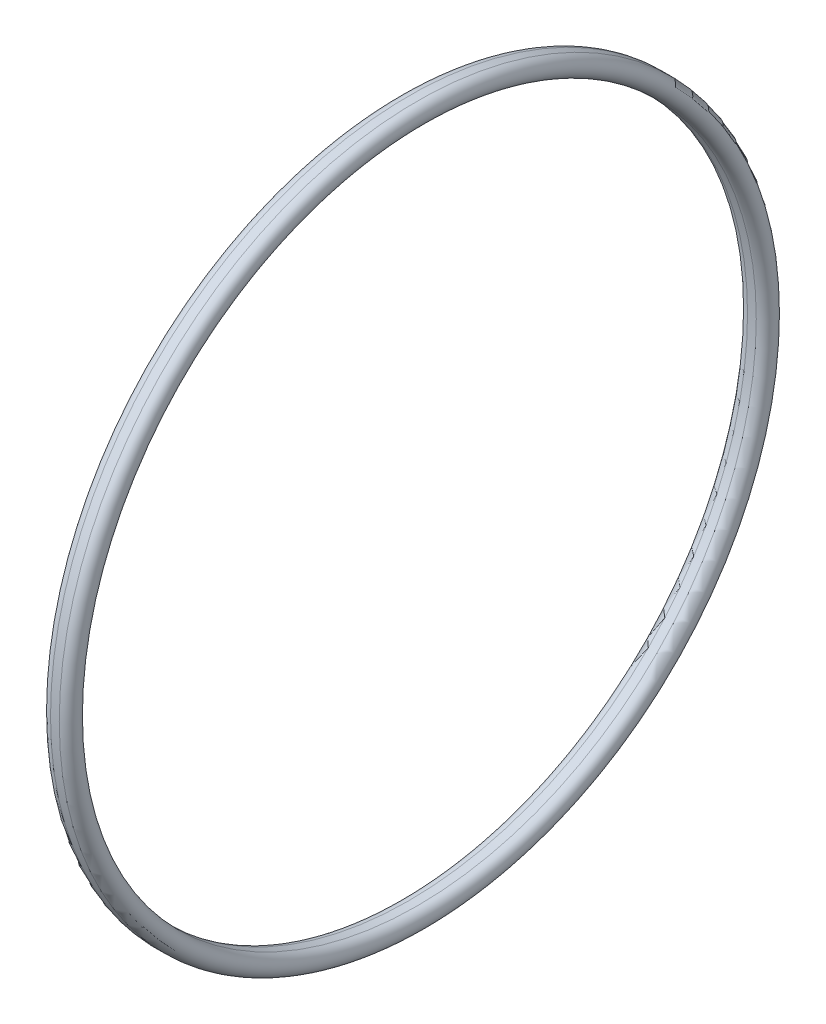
ISO-10303-21;
HEADER;
FILE_DESCRIPTION(('STEP AP214'),'2;1');
FILE_NAME('part.step','',(''),(''),'','','');
FILE_SCHEMA(('AUTOMOTIVE_DESIGN { 1 0 10303 214 1 1 1 1 }'));
ENDSEC;
DATA;
#1=APPLICATION_CONTEXT('core data for automotive mechanical design processes');
#2=APPLICATION_PROTOCOL_DEFINITION('international standard','automotive_design',2000,#1);
#3=PRODUCT_CONTEXT('',#1,'mechanical');
#4=PRODUCT('Part','Part','',(#3));
#5=PRODUCT_RELATED_PRODUCT_CATEGORY('part','',(#4));
#6=PRODUCT_DEFINITION_FORMATION('','',#4);
#7=PRODUCT_DEFINITION_CONTEXT('part definition',#1,'design');
#8=PRODUCT_DEFINITION('design','',#6,#7);
#9=PRODUCT_DEFINITION_SHAPE('','',#8);
#10=(LENGTH_UNIT() NAMED_UNIT(*) SI_UNIT(.MILLI.,.METRE.));
#11=(NAMED_UNIT(*) PLANE_ANGLE_UNIT() SI_UNIT($,.RADIAN.));
#12=(NAMED_UNIT(*) SI_UNIT($,.STERADIAN.) SOLID_ANGLE_UNIT());
#13=UNCERTAINTY_MEASURE_WITH_UNIT(LENGTH_MEASURE(1.E-05),#10,'distance_accuracy_value','');
#14=(GEOMETRIC_REPRESENTATION_CONTEXT(3) GLOBAL_UNCERTAINTY_ASSIGNED_CONTEXT((#13)) GLOBAL_UNIT_ASSIGNED_CONTEXT((#10,
#11,#12)) REPRESENTATION_CONTEXT('',''));
#15=CARTESIAN_POINT('',(0.,0.,0.));
#16=DIRECTION('',(0.,0.,1.));
#17=DIRECTION('',(1.,0.,0.));
#18=AXIS2_PLACEMENT_3D('',#15,#16,#17);
#19=CARTESIAN_POINT('',(-0.625000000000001,0.,0.));
#20=DIRECTION('',(-1.,0.,0.));
#21=DIRECTION('',(0.,0.,1.));
#22=AXIS2_PLACEMENT_3D('',#19,#20,#21);
#23=TOROIDAL_SURFACE('',#22,49.925,1.375);
#24=CARTESIAN_POINT('',(-0.625000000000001,0.,0.));
#25=DIRECTION('',(-1.,0.,0.));
#26=DIRECTION('',(0.,0.,1.));
#27=AXIS2_PLACEMENT_3D('',#24,#25,#26);
#28=CIRCLE('',#27,48.55);
#29=CARTESIAN_POINT('',(-0.625000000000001,0.,48.55));
#30=VERTEX_POINT('',#29);
#31=EDGE_CURVE('E10',#30,#30,#28,.T.);
#32=ORIENTED_EDGE('',*,*,#31,.F.);
#33=EDGE_LOOP('',(#32));
#34=FACE_BOUND('',#33,.T.);
#35=CARTESIAN_POINT('',(-0.625000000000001,0.,0.));
#36=DIRECTION('',(-1.,0.,0.));
#37=DIRECTION('',(0.,0.,1.));
#38=AXIS2_PLACEMENT_3D('',#35,#36,#37);
#39=CIRCLE('',#38,51.3);
#40=CARTESIAN_POINT('',(-0.625000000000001,0.,51.3));
#41=VERTEX_POINT('',#40);
#42=EDGE_CURVE('E44',#41,#41,#39,.T.);
#43=ORIENTED_EDGE('',*,*,#42,.T.);
#44=EDGE_LOOP('',(#43));
#45=FACE_BOUND('',#44,.T.);
#46=ADVANCED_FACE('F30',(#34,#45),#23,.T.);
#47=CARTESIAN_POINT('',(0.,0.,0.));
#48=DIRECTION('',(-1.,0.,0.));
#49=DIRECTION('',(0.,0.,1.));
#50=AXIS2_PLACEMENT_3D('',#47,#48,#49);
#51=CYLINDRICAL_SURFACE('',#50,48.55);
#52=CARTESIAN_POINT('',(0.625000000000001,0.,0.));
#53=DIRECTION('',(-1.,0.,0.));
#54=DIRECTION('',(0.,0.,1.));
#55=AXIS2_PLACEMENT_3D('',#52,#53,#54);
#56=CIRCLE('',#55,48.55);
#57=CARTESIAN_POINT('',(0.625000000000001,0.,48.55));
#58=VERTEX_POINT('',#57);
#59=EDGE_CURVE('E36',#58,#58,#56,.T.);
#60=ORIENTED_EDGE('',*,*,#59,.F.);
#61=EDGE_LOOP('',(#60));
#62=FACE_BOUND('',#61,.T.);
#63=ORIENTED_EDGE('',*,*,#31,.T.);
#64=EDGE_LOOP('',(#63));
#65=FACE_BOUND('',#64,.T.);
#66=ADVANCED_FACE('F59',(#62,#65),#51,.F.);
#67=CARTESIAN_POINT('',(0.625000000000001,0.,0.));
#68=DIRECTION('',(-1.,0.,0.));
#69=DIRECTION('',(0.,0.,1.));
#70=AXIS2_PLACEMENT_3D('',#67,#68,#69);
#71=TOROIDAL_SURFACE('',#70,49.925,1.375);
#72=CARTESIAN_POINT('',(0.625000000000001,0.,0.));
#73=DIRECTION('',(-1.,0.,0.));
#74=DIRECTION('',(0.,0.,1.));
#75=AXIS2_PLACEMENT_3D('',#72,#73,#74);
#76=CIRCLE('',#75,51.3);
#77=CARTESIAN_POINT('',(0.625000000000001,0.,51.3));
#78=VERTEX_POINT('',#77);
#79=EDGE_CURVE('E40',#78,#78,#76,.T.);
#80=ORIENTED_EDGE('',*,*,#79,.F.);
#81=EDGE_LOOP('',(#80));
#82=FACE_BOUND('',#81,.T.);
#83=ORIENTED_EDGE('',*,*,#59,.T.);
#84=EDGE_LOOP('',(#83));
#85=FACE_BOUND('',#84,.T.);
#86=ADVANCED_FACE('F54',(#82,#85),#71,.T.);
#87=CARTESIAN_POINT('',(0.,0.,0.));
#88=DIRECTION('',(-1.,0.,0.));
#89=DIRECTION('',(0.,0.,1.));
#90=AXIS2_PLACEMENT_3D('',#87,#88,#89);
#91=CYLINDRICAL_SURFACE('',#90,51.3);
#92=ORIENTED_EDGE('',*,*,#42,.F.);
#93=EDGE_LOOP('',(#92));
#94=FACE_BOUND('',#93,.T.);
#95=ORIENTED_EDGE('',*,*,#79,.T.);
#96=EDGE_LOOP('',(#95));
#97=FACE_BOUND('',#96,.T.);
#98=ADVANCED_FACE('F51',(#94,#97),#91,.T.);
#99=CLOSED_SHELL('',(#46,#66,#86,#98));
#100=MANIFOLD_SOLID_BREP('B2',#99);
#101=ADVANCED_BREP_SHAPE_REPRESENTATION('',(#18,#100),#14);
#102=SHAPE_DEFINITION_REPRESENTATION(#9,#101);
ENDSEC;
END-ISO-10303-21;
